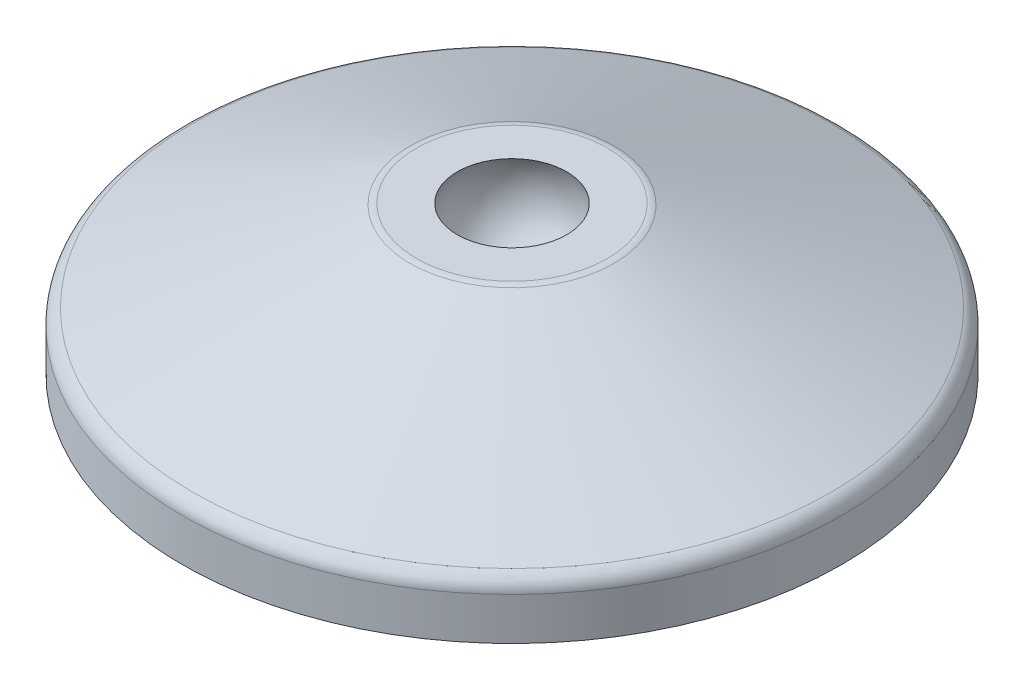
ISO-10303-21;
HEADER;
FILE_DESCRIPTION(('STEP AP214'),'2;1');
FILE_NAME('part.step','',(''),(''),'','','');
FILE_SCHEMA(('AUTOMOTIVE_DESIGN { 1 0 10303 214 1 1 1 1 }'));
ENDSEC;
DATA;
#1=APPLICATION_CONTEXT('core data for automotive mechanical design processes');
#2=APPLICATION_PROTOCOL_DEFINITION('international standard','automotive_design',2000,#1);
#3=PRODUCT_CONTEXT('',#1,'mechanical');
#4=PRODUCT('Part','Part','',(#3));
#5=PRODUCT_RELATED_PRODUCT_CATEGORY('part','',(#4));
#6=PRODUCT_DEFINITION_FORMATION('','',#4);
#7=PRODUCT_DEFINITION_CONTEXT('part definition',#1,'design');
#8=PRODUCT_DEFINITION('design','',#6,#7);
#9=PRODUCT_DEFINITION_SHAPE('','',#8);
#10=(LENGTH_UNIT() NAMED_UNIT(*) SI_UNIT(.MILLI.,.METRE.));
#11=(NAMED_UNIT(*) PLANE_ANGLE_UNIT() SI_UNIT($,.RADIAN.));
#12=(NAMED_UNIT(*) SI_UNIT($,.STERADIAN.) SOLID_ANGLE_UNIT());
#13=UNCERTAINTY_MEASURE_WITH_UNIT(LENGTH_MEASURE(1.E-05),#10,'distance_accuracy_value','');
#14=(GEOMETRIC_REPRESENTATION_CONTEXT(3) GLOBAL_UNCERTAINTY_ASSIGNED_CONTEXT((#13)) GLOBAL_UNIT_ASSIGNED_CONTEXT((#10,
#11,#12)) REPRESENTATION_CONTEXT('',''));
#15=CARTESIAN_POINT('',(0.,0.,0.));
#16=DIRECTION('',(0.,0.,1.));
#17=DIRECTION('',(1.,0.,0.));
#18=AXIS2_PLACEMENT_3D('',#15,#16,#17);
#19=CARTESIAN_POINT('',(0.,0.999999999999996,0.));
#20=DIRECTION('',(0.,1.,0.));
#21=DIRECTION('',(0.,0.,1.));
#22=AXIS2_PLACEMENT_3D('',#19,#20,#21);
#23=PLANE('',#22);
#24=CARTESIAN_POINT('',(0.,0.999999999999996,0.));
#25=DIRECTION('',(0.,1.,0.));
#26=DIRECTION('',(-1.,0.,0.));
#27=AXIS2_PLACEMENT_3D('',#24,#25,#26);
#28=CIRCLE('',#27,7.5);
#29=CARTESIAN_POINT('',(-7.5,0.999999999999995,0.));
#30=VERTEX_POINT('',#29);
#31=EDGE_CURVE('E18',#30,#30,#28,.T.);
#32=ORIENTED_EDGE('',*,*,#31,.F.);
#33=EDGE_LOOP('',(#32));
#34=FACE_BOUND('',#33,.T.);
#35=ADVANCED_FACE('F14',(#34),#23,.F.);
#36=CARTESIAN_POINT('',(0.,0.,0.));
#37=DIRECTION('',(0.,1.,0.));
#38=DIRECTION('',(-1.,0.,0.));
#39=AXIS2_PLACEMENT_3D('',#36,#37,#38);
#40=CYLINDRICAL_SURFACE('',#39,7.5);
#41=CARTESIAN_POINT('',(0.,5.,0.));
#42=DIRECTION('',(0.,1.,0.));
#43=DIRECTION('',(-1.,0.,0.));
#44=AXIS2_PLACEMENT_3D('',#41,#42,#43);
#45=CIRCLE('',#44,7.5);
#46=CARTESIAN_POINT('',(-7.5,4.99999999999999,0.));
#47=VERTEX_POINT('',#46);
#48=EDGE_CURVE('E72',#47,#47,#45,.F.);
#49=ORIENTED_EDGE('',*,*,#48,.T.);
#50=EDGE_LOOP('',(#49));
#51=FACE_BOUND('',#50,.T.);
#52=ORIENTED_EDGE('',*,*,#31,.T.);
#53=EDGE_LOOP('',(#52));
#54=FACE_BOUND('',#53,.T.);
#55=ADVANCED_FACE('F79',(#51,#54),#40,.T.);
#56=CARTESIAN_POINT('',(0.,5.,0.));
#57=DIRECTION('',(0.,1.,0.));
#58=DIRECTION('',(0.,0.,1.));
#59=AXIS2_PLACEMENT_3D('',#56,#57,#58);
#60=PLANE('',#59);
#61=ORIENTED_EDGE('',*,*,#48,.F.);
#62=EDGE_LOOP('',(#61));
#63=FACE_BOUND('',#62,.T.);
#64=CARTESIAN_POINT('',(0.,5.,0.));
#65=DIRECTION('',(0.,1.,0.));
#66=DIRECTION('',(0.,0.,1.));
#67=AXIS2_PLACEMENT_3D('',#64,#65,#66);
#68=CIRCLE('',#67,36.);
#69=CARTESIAN_POINT('',(0.,5.,36.));
#70=VERTEX_POINT('',#69);
#71=EDGE_CURVE('E70',#70,#70,#68,.F.);
#72=ORIENTED_EDGE('',*,*,#71,.T.);
#73=EDGE_LOOP('',(#72));
#74=FACE_BOUND('',#73,.T.);
#75=ADVANCED_FACE('F86',(#63,#74),#60,.F.);
#76=CARTESIAN_POINT('',(0.,0.,0.));
#77=DIRECTION('',(0.,1.,0.));
#78=DIRECTION('',(0.,0.,1.));
#79=AXIS2_PLACEMENT_3D('',#76,#77,#78);
#80=CYLINDRICAL_SURFACE('',#79,36.);
#81=CARTESIAN_POINT('',(0.,0.,0.));
#82=DIRECTION('',(0.,1.,0.));
#83=DIRECTION('',(0.,0.,1.));
#84=AXIS2_PLACEMENT_3D('',#81,#82,#83);
#85=CIRCLE('',#84,36.);
#86=CARTESIAN_POINT('',(0.,0.,36.));
#87=VERTEX_POINT('',#86);
#88=EDGE_CURVE('E67',#87,#87,#85,.T.);
#89=ORIENTED_EDGE('',*,*,#88,.F.);
#90=EDGE_LOOP('',(#89));
#91=FACE_BOUND('',#90,.T.);
#92=ORIENTED_EDGE('',*,*,#71,.F.);
#93=EDGE_LOOP('',(#92));
#94=FACE_BOUND('',#93,.T.);
#95=ADVANCED_FACE('F122',(#91,#94),#80,.F.);
#96=CARTESIAN_POINT('',(20.,0.,0.));
#97=DIRECTION('',(0.,-1.,0.));
#98=DIRECTION('',(0.,0.,-1.));
#99=AXIS2_PLACEMENT_3D('',#96,#97,#98);
#100=PLANE('',#99);
#101=ORIENTED_EDGE('',*,*,#88,.T.);
#102=EDGE_LOOP('',(#101));
#103=FACE_BOUND('',#102,.T.);
#104=CARTESIAN_POINT('',(0.,0.,0.));
#105=DIRECTION('',(0.,-1.,0.));
#106=DIRECTION('',(1.,0.,0.));
#107=AXIS2_PLACEMENT_3D('',#104,#105,#106);
#108=CIRCLE('',#107,40.);
#109=CARTESIAN_POINT('',(40.,0.,0.));
#110=VERTEX_POINT('',#109);
#111=EDGE_CURVE('E64',#110,#110,#108,.F.);
#112=ORIENTED_EDGE('',*,*,#111,.F.);
#113=EDGE_LOOP('',(#112));
#114=FACE_BOUND('',#113,.T.);
#115=ADVANCED_FACE('F119',(#103,#114),#100,.T.);
#116=CARTESIAN_POINT('',(0.,14.5,0.));
#117=DIRECTION('',(0.,0.,1.));
#118=DIRECTION('',(1.,0.,0.));
#119=AXIS2_PLACEMENT_3D('',#116,#117,#118);
#120=SPHERICAL_SURFACE('',#119,7.5);
#121=CARTESIAN_POINT('',(0.,14.5,0.));
#122=DIRECTION('',(0.,1.,0.));
#123=DIRECTION('',(0.,0.,1.));
#124=AXIS2_PLACEMENT_3D('',#121,#122,#123);
#125=SPHERICAL_SURFACE('',#124,7.5);
#126=CARTESIAN_POINT('',(0.,18.,0.));
#127=DIRECTION('',(0.,1.,0.));
#128=DIRECTION('',(0.,0.,1.));
#129=AXIS2_PLACEMENT_3D('',#126,#127,#128);
#130=CIRCLE('',#129,6.6332495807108);
#131=CARTESIAN_POINT('',(0.,18.,6.6332495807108));
#132=VERTEX_POINT('',#131);
#133=EDGE_CURVE('E55',#132,#132,#130,.F.);
#134=ORIENTED_EDGE('',*,*,#133,.F.);
#135=EDGE_LOOP('',(#134));
#136=FACE_BOUND('',#135,.T.);
#137=ADVANCED_FACE('F16',(#136),#125,.F.);
#138=CARTESIAN_POINT('',(0.,2.57965636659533,0.));
#139=DIRECTION('',(0.,-1.,0.));
#140=DIRECTION('',(1.,0.,0.));
#141=AXIS2_PLACEMENT_3D('',#138,#139,#140);
#142=CYLINDRICAL_SURFACE('',#141,40.);
#143=CARTESIAN_POINT('',(0.,5.15931273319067,0.));
#144=DIRECTION('',(0.,-1.,0.));
#145=DIRECTION('',(0.,0.,-1.));
#146=AXIS2_PLACEMENT_3D('',#143,#144,#145);
#147=CIRCLE('',#146,40.);
#148=CARTESIAN_POINT('',(0.,5.15931273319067,-40.));
#149=VERTEX_POINT('',#148);
#150=EDGE_CURVE('E63',#149,#149,#147,.F.);
#151=ORIENTED_EDGE('',*,*,#150,.F.);
#152=EDGE_LOOP('',(#151));
#153=FACE_BOUND('',#152,.T.);
#154=ORIENTED_EDGE('',*,*,#111,.T.);
#155=EDGE_LOOP('',(#154));
#156=FACE_BOUND('',#155,.T.);
#157=ADVANCED_FACE('F115',(#153,#156),#142,.T.);
#158=CARTESIAN_POINT('',(9.11926637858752,18.,0.));
#159=DIRECTION('',(0.,1.,0.));
#160=DIRECTION('',(0.,0.,1.));
#161=AXIS2_PLACEMENT_3D('',#158,#159,#160);
#162=PLANE('',#161);
#163=ORIENTED_EDGE('',*,*,#133,.T.);
#164=EDGE_LOOP('',(#163));
#165=FACE_BOUND('',#164,.T.);
#166=CARTESIAN_POINT('',(0.,18.,0.));
#167=DIRECTION('',(0.,-1.,0.));
#168=DIRECTION('',(1.,0.,0.));
#169=AXIS2_PLACEMENT_3D('',#166,#167,#168);
#170=CIRCLE('',#169,11.6052831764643);
#171=CARTESIAN_POINT('',(11.6052831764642,18.,0.));
#172=VERTEX_POINT('',#171);
#173=EDGE_CURVE('E27',#172,#172,#170,.T.);
#174=ORIENTED_EDGE('',*,*,#173,.F.);
#175=EDGE_LOOP('',(#174));
#176=FACE_BOUND('',#175,.T.);
#177=ADVANCED_FACE('F96',(#165,#176),#162,.T.);
#178=CARTESIAN_POINT('',(0.,5.15931273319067,0.));
#179=DIRECTION('',(0.,-1.,0.));
#180=DIRECTION('',(0.,0.,-1.));
#181=AXIS2_PLACEMENT_3D('',#178,#179,#180);
#182=TOROIDAL_SURFACE('',#181,38.,2.);
#183=CARTESIAN_POINT('',(0.,7.00935235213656,0.));
#184=DIRECTION('',(0.,-1.,0.));
#185=DIRECTION('',(1.,0.,0.));
#186=AXIS2_PLACEMENT_3D('',#183,#184,#185);
#187=CIRCLE('',#186,38.7598377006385);
#188=CARTESIAN_POINT('',(38.7598377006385,7.00935235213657,0.));
#189=VERTEX_POINT('',#188);
#190=EDGE_CURVE('E22',#189,#189,#187,.F.);
#191=ORIENTED_EDGE('',*,*,#190,.F.);
#192=EDGE_LOOP('',(#191));
#193=FACE_BOUND('',#192,.T.);
#194=ORIENTED_EDGE('',*,*,#150,.T.);
#195=EDGE_LOOP('',(#194));
#196=FACE_BOUND('',#195,.T.);
#197=ADVANCED_FACE('F45',(#193,#196),#182,.T.);
#198=CARTESIAN_POINT('',(0.,16.,0.));
#199=DIRECTION('',(0.,-1.,0.));
#200=DIRECTION('',(0.,0.,-1.));
#201=AXIS2_PLACEMENT_3D('',#198,#199,#200);
#202=TOROIDAL_SURFACE('',#201,11.6052831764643,2.);
#203=ORIENTED_EDGE('',*,*,#173,.T.);
#204=EDGE_LOOP('',(#203));
#205=FACE_BOUND('',#204,.T.);
#206=CARTESIAN_POINT('',(0.,17.8500396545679,0.));
#207=DIRECTION('',(0.,-1.,0.));
#208=DIRECTION('',(1.,0.,0.));
#209=AXIS2_PLACEMENT_3D('',#206,#207,#208);
#210=CIRCLE('',#209,12.3651208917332);
#211=CARTESIAN_POINT('',(12.3651208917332,17.8500396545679,0.));
#212=VERTEX_POINT('',#211);
#213=EDGE_CURVE('E10',#212,#212,#210,.T.);
#214=ORIENTED_EDGE('',*,*,#213,.F.);
#215=EDGE_LOOP('',(#214));
#216=FACE_BOUND('',#215,.T.);
#217=ADVANCED_FACE('F39',(#205,#216),#202,.T.);
#218=CARTESIAN_POINT('',(0.,7.00935235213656,0.));
#219=DIRECTION('',(0.,-1.,0.));
#220=DIRECTION('',(1.,0.,0.));
#221=AXIS2_PLACEMENT_3D('',#218,#219,#220);
#222=CONICAL_SURFACE('',#221,38.7598377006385,1.18108775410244);
#223=CARTESIAN_POINT('',(12.3651208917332,17.8500396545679,0.));
#224=CARTESIAN_POINT('',(12.6400658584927,17.7371158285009,0.));
#225=CARTESIAN_POINT('',(12.9150108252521,17.6241920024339,0.));
#226=CARTESIAN_POINT('',(13.4649007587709,17.3983443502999,0.));
#227=CARTESIAN_POINT('',(13.7398457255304,17.285420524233,0.));
#228=CARTESIAN_POINT('',(14.2897356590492,17.059572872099,0.));
#229=CARTESIAN_POINT('',(14.5646806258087,16.946649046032,0.));
#230=CARTESIAN_POINT('',(15.1145705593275,16.720801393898,0.));
#231=CARTESIAN_POINT('',(15.389515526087,16.607877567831,0.));
#232=CARTESIAN_POINT('',(15.9394054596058,16.382029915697,0.));
#233=CARTESIAN_POINT('',(16.2143504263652,16.26910608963,0.));
#234=CARTESIAN_POINT('',(16.7642403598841,16.043258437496,0.));
#235=CARTESIAN_POINT('',(17.0391853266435,15.930334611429,0.));
#236=CARTESIAN_POINT('',(17.5890752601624,15.704486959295,0.));
#237=CARTESIAN_POINT('',(17.8640202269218,15.5915631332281,0.));
#238=CARTESIAN_POINT('',(18.4139101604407,15.3657154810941,0.));
#239=CARTESIAN_POINT('',(18.6888551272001,15.2527916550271,0.));
#240=CARTESIAN_POINT('',(19.238745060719,15.0269440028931,0.));
#241=CARTESIAN_POINT('',(19.5136900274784,14.9140201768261,0.));
#242=CARTESIAN_POINT('',(20.0635799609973,14.6881725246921,0.));
#243=CARTESIAN_POINT('',(20.3385249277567,14.5752486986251,0.));
#244=CARTESIAN_POINT('',(20.8884148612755,14.3494010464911,0.));
#245=CARTESIAN_POINT('',(21.163359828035,14.2364772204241,0.));
#246=CARTESIAN_POINT('',(21.7132497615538,14.0106295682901,0.));
#247=CARTESIAN_POINT('',(21.9881947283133,13.8977057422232,0.));
#248=CARTESIAN_POINT('',(22.5380846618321,13.6718580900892,0.));
#249=CARTESIAN_POINT('',(22.8130296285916,13.5589342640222,0.));
#250=CARTESIAN_POINT('',(23.3629195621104,13.3330866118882,0.));
#251=CARTESIAN_POINT('',(23.6378645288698,13.2201627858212,0.));
#252=CARTESIAN_POINT('',(24.1877544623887,12.9943151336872,0.));
#253=CARTESIAN_POINT('',(24.4626994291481,12.8813913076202,0.));
#254=CARTESIAN_POINT('',(25.012589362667,12.6555436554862,0.));
#255=CARTESIAN_POINT('',(25.2875343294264,12.5426198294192,0.));
#256=CARTESIAN_POINT('',(25.8374242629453,12.3167721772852,0.));
#257=CARTESIAN_POINT('',(26.1123692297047,12.2038483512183,0.));
#258=CARTESIAN_POINT('',(26.6622591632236,11.9780006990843,0.));
#259=CARTESIAN_POINT('',(26.937204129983,11.8650768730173,0.));
#260=CARTESIAN_POINT('',(27.4870940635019,11.6392292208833,0.));
#261=CARTESIAN_POINT('',(27.7620390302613,11.5263053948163,0.));
#262=CARTESIAN_POINT('',(28.3119289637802,11.3004577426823,0.));
#263=CARTESIAN_POINT('',(28.5868739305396,11.1875339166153,0.));
#264=CARTESIAN_POINT('',(29.1367638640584,10.9616862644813,0.));
#265=CARTESIAN_POINT('',(29.4117088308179,10.8487624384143,0.));
#266=CARTESIAN_POINT('',(29.9615987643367,10.6229147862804,0.));
#267=CARTESIAN_POINT('',(30.2365437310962,10.5099909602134,0.));
#268=CARTESIAN_POINT('',(30.786433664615,10.2841433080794,0.));
#269=CARTESIAN_POINT('',(31.0613786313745,10.1712194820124,0.));
#270=CARTESIAN_POINT('',(31.6112685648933,9.94537182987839,0.));
#271=CARTESIAN_POINT('',(31.8862135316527,9.8324480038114,0.));
#272=CARTESIAN_POINT('',(32.4361034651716,9.60660035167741,0.));
#273=CARTESIAN_POINT('',(32.711048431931,9.49367652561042,0.));
#274=CARTESIAN_POINT('',(33.2609383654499,9.26782887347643,0.));
#275=CARTESIAN_POINT('',(33.5358833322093,9.15490504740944,0.));
#276=CARTESIAN_POINT('',(34.0857732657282,8.92905739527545,0.));
#277=CARTESIAN_POINT('',(34.3607182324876,8.81613356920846,0.));
#278=CARTESIAN_POINT('',(34.9106081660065,8.59028591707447,0.));
#279=CARTESIAN_POINT('',(35.1855531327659,8.47736209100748,0.));
#280=CARTESIAN_POINT('',(35.7354430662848,8.25151443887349,0.));
#281=CARTESIAN_POINT('',(36.0103880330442,8.1385906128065,0.));
#282=CARTESIAN_POINT('',(36.560277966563,7.91274296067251,0.));
#283=CARTESIAN_POINT('',(36.8352229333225,7.79981913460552,0.));
#284=CARTESIAN_POINT('',(37.3851128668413,7.57397148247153,0.));
#285=CARTESIAN_POINT('',(37.6600578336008,7.46104765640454,0.));
#286=CARTESIAN_POINT('',(38.2099477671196,7.23520000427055,0.));
#287=CARTESIAN_POINT('',(38.4848927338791,7.12227617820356,0.));
#288=CARTESIAN_POINT('',(38.7598377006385,7.00935235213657,0.));
#289=B_SPLINE_CURVE_WITH_KNOTS('',3,(#223,#224,#225,#226,#227,#228,#229,#230,#231,#232,#233,
#234,#235,#236,#237,#238,#239,#240,#241,#242,#243,#244,#245,#246,#247,#248,#249,#250,#251,#252,
#253,#254,#255,#256,#257,#258,#259,#260,#261,#262,#263,#264,#265,#266,#267,#268,#269,#270,#271,
#272,#273,#274,#275,#276,#277,#278,#279,#280,#281,#282,#283,#284,#285,#286,#287,#288),
.UNSPECIFIED.,.F.,.F.,(4,2,2,2,2,2,2,2,2,2,2,2,2,2,2,2,2,2,2,2,2,2,2,2,2,2,2,2,2,2,2,2,4),(0.,
0.891694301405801,1.78338860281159,2.67508290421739,3.56677720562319,4.45847150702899,
5.35016580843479,6.24186010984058,7.13355441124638,8.02524871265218,8.91694301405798,
9.80863731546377,10.7003316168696,11.5920259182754,12.4837202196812,13.375414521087,
14.2671088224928,15.1588031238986,16.0504974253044,16.9421917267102,17.833886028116,
18.7255803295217,19.6172746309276,20.5089689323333,21.4006632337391,22.2923575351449,
23.1840518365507,24.0757461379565,24.9674404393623,25.8591347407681,26.7508290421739,
27.6425233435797,28.5342176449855),.UNSPECIFIED.);
#290=EDGE_CURVE('BSEAM44',#212,#189,#289,.T.);
#291=ORIENTED_EDGE('',*,*,#213,.T.);
#292=ORIENTED_EDGE('',*,*,#190,.T.);
#293=ORIENTED_EDGE('',*,*,#290,.T.);
#294=ORIENTED_EDGE('',*,*,#290,.F.);
#295=EDGE_LOOP('',(#291,#293,#292,#294));
#296=FACE_BOUND('',#295,.T.);
#297=ADVANCED_FACE('F44',(#296),#222,.T.);
#298=CLOSED_SHELL('',(#35,#55,#75,#95,#115,#137,#157,#177,#197,#217,#297));
#299=MANIFOLD_SOLID_BREP('B1',#298);
#300=ADVANCED_BREP_SHAPE_REPRESENTATION('',(#18,#299),#14);
#301=SHAPE_DEFINITION_REPRESENTATION(#9,#300);
ENDSEC;
END-ISO-10303-21;
